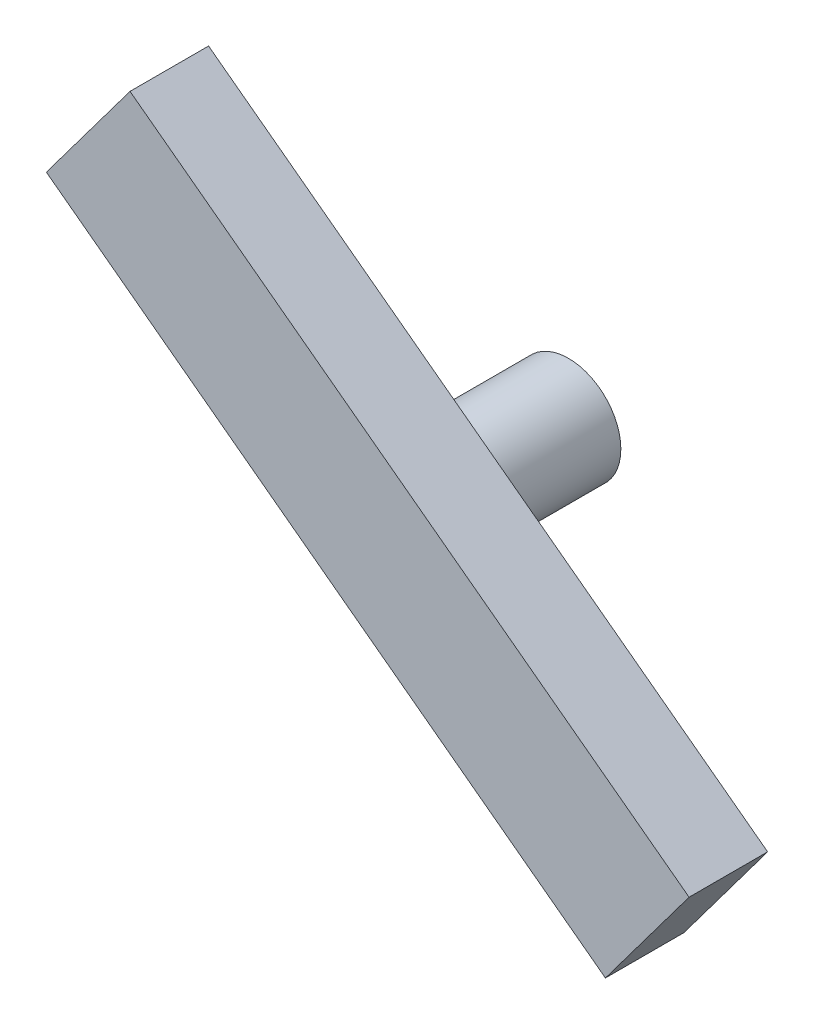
from build123d import *

# Parameters (mm, degrees)
VASTAGO_PROFILE_R = 3
GOMA_START        = -15
GOMA_DEPTH        = 4.5


with BuildPart() as part:
    # Vastago: sweep along a curve in space
    with BuildLine() as vastago_path:
        Line((-263.128358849, 316.504901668, -22), (-263.128358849, 316.504901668, -15))
    # Vastago profile (on start of the path) → Vastago (sweep)
    with BuildSketch(Plane(origin=(-263.128358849, 316.504901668, -22), x_dir=(1, 0, 0), z_dir=(0, 0, 1))):
        Circle(VASTAGO_PROFILE_R)
    sweep(path=vastago_path.line)

    # Sk_Goma → Goma (add)
    with BuildSketch(Plane.XY.offset(GOMA_START)):
        Polygon((-249.511779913, 301.319751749), (-244.718766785, 307.724985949), (-276.744937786, 331.690051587), (-281.537950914, 325.284817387), align=None)
    extrude(amount=GOMA_DEPTH)


solid = part.part
